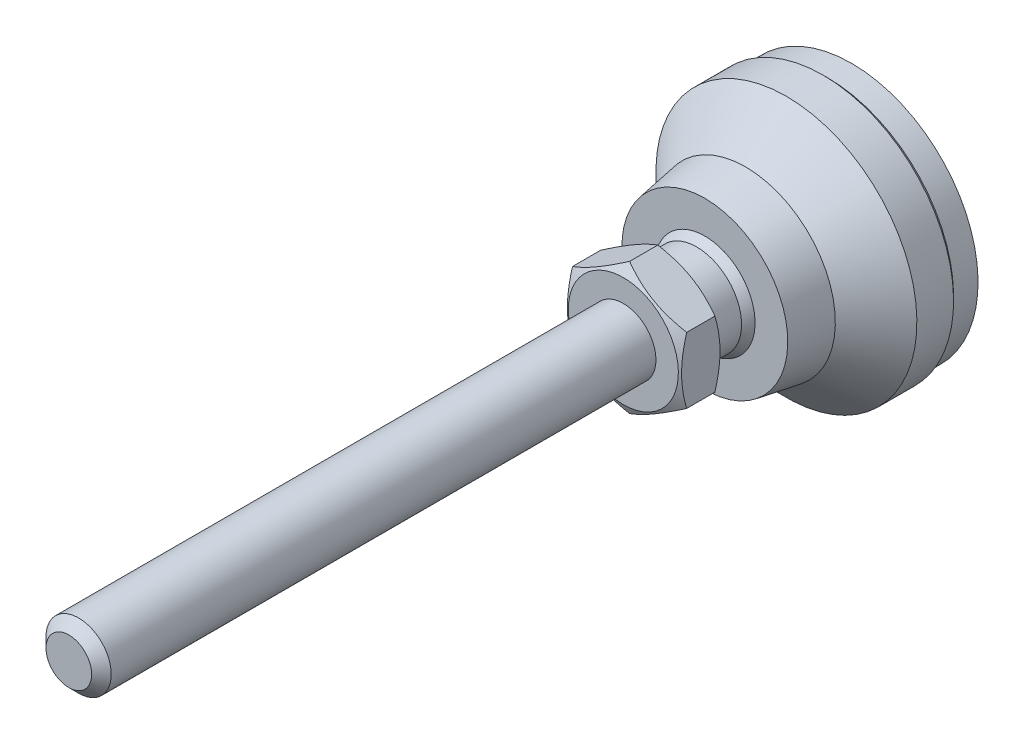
ISO-10303-21;
HEADER;
FILE_DESCRIPTION(('STEP AP214'),'2;1');
FILE_NAME('part.step','',(''),(''),'','','');
FILE_SCHEMA(('AUTOMOTIVE_DESIGN { 1 0 10303 214 1 1 1 1 }'));
ENDSEC;
DATA;
#1=APPLICATION_CONTEXT('core data for automotive mechanical design processes');
#2=APPLICATION_PROTOCOL_DEFINITION('international standard','automotive_design',2000,#1);
#3=PRODUCT_CONTEXT('',#1,'mechanical');
#4=PRODUCT('Part','Part','',(#3));
#5=PRODUCT_RELATED_PRODUCT_CATEGORY('part','',(#4));
#6=PRODUCT_DEFINITION_FORMATION('','',#4);
#7=PRODUCT_DEFINITION_CONTEXT('part definition',#1,'design');
#8=PRODUCT_DEFINITION('design','',#6,#7);
#9=PRODUCT_DEFINITION_SHAPE('','',#8);
#10=(LENGTH_UNIT() NAMED_UNIT(*) SI_UNIT(.MILLI.,.METRE.));
#11=(NAMED_UNIT(*) PLANE_ANGLE_UNIT() SI_UNIT($,.RADIAN.));
#12=(NAMED_UNIT(*) SI_UNIT($,.STERADIAN.) SOLID_ANGLE_UNIT());
#13=UNCERTAINTY_MEASURE_WITH_UNIT(LENGTH_MEASURE(1.E-05),#10,'distance_accuracy_value','');
#14=(GEOMETRIC_REPRESENTATION_CONTEXT(3) GLOBAL_UNCERTAINTY_ASSIGNED_CONTEXT((#13)) GLOBAL_UNIT_ASSIGNED_CONTEXT((#10,
#11,#12)) REPRESENTATION_CONTEXT('',''));
#15=CARTESIAN_POINT('',(0.,0.,0.));
#16=DIRECTION('',(0.,0.,1.));
#17=DIRECTION('',(1.,0.,0.));
#18=AXIS2_PLACEMENT_3D('',#15,#16,#17);
#19=CARTESIAN_POINT('',(0.,0.,3.));
#20=DIRECTION('',(0.,0.,-1.));
#21=DIRECTION('',(0.,1.,0.));
#22=AXIS2_PLACEMENT_3D('',#19,#20,#21);
#23=CYLINDRICAL_SURFACE('',#22,5.49999999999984);
#24=CARTESIAN_POINT('',(0.,0.,23.));
#25=DIRECTION('',(0.,0.,-1.));
#26=DIRECTION('',(0.,1.,0.));
#27=AXIS2_PLACEMENT_3D('',#24,#25,#26);
#28=CIRCLE('',#27,5.49999999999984);
#29=CARTESIAN_POINT('',(0.,5.49999999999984,23.));
#30=VERTEX_POINT('',#29);
#31=EDGE_CURVE('E111',#30,#30,#28,.T.);
#32=ORIENTED_EDGE('',*,*,#31,.T.);
#33=EDGE_LOOP('',(#32));
#34=FACE_BOUND('',#33,.T.);
#35=CARTESIAN_POINT('',(0.,0.,19.0000000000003));
#36=DIRECTION('',(0.,0.,1.));
#37=DIRECTION('',(0.,-1.,0.));
#38=AXIS2_PLACEMENT_3D('',#35,#36,#37);
#39=CIRCLE('',#38,5.49999999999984);
#40=CARTESIAN_POINT('',(-5.49999999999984,0.,19.0000000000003));
#41=VERTEX_POINT('',#40);
#42=EDGE_CURVE('E113',#41,#41,#39,.T.);
#43=ORIENTED_EDGE('',*,*,#42,.T.);
#44=EDGE_LOOP('',(#43));
#45=FACE_BOUND('',#44,.T.);
#46=ADVANCED_FACE('F14',(#34,#45),#23,.T.);
#47=CARTESIAN_POINT('',(0.,0.,14.6698729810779));
#48=DIRECTION('',(0.,0.,1.));
#49=DIRECTION('',(-1.,0.,0.));
#50=AXIS2_PLACEMENT_3D('',#47,#48,#49);
#51=SPHERICAL_SURFACE('',#50,7.);
#52=CARTESIAN_POINT('',(0.,0.,18.));
#53=DIRECTION('',(0.,0.,1.));
#54=DIRECTION('',(0.,-1.,0.));
#55=AXIS2_PLACEMENT_3D('',#52,#53,#54);
#56=CIRCLE('',#55,6.15713034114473);
#57=CARTESIAN_POINT('',(-6.15713034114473,0.,18.));
#58=VERTEX_POINT('',#57);
#59=EDGE_CURVE('E118',#58,#58,#56,.T.);
#60=CARTESIAN_POINT('',(-5.49999999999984,0.,19.0000000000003));
#61=CARTESIAN_POINT('',(-5.50771979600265,0.,18.9901945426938));
#62=CARTESIAN_POINT('',(-5.51541336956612,0.,18.9803684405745));
#63=CARTESIAN_POINT('',(-5.53074785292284,0.,18.9606752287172));
#64=CARTESIAN_POINT('',(-5.53838876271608,0.,18.9508081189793));
#65=CARTESIAN_POINT('',(-5.55361769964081,0.,18.9310331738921));
#66=CARTESIAN_POINT('',(-5.56120572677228,0.,18.9211253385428));
#67=CARTESIAN_POINT('',(-5.57632868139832,0.,18.9012692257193));
#68=CARTESIAN_POINT('',(-5.58386360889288,0.,18.8913209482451));
#69=CARTESIAN_POINT('',(-5.59888014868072,0.,18.871384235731));
#70=CARTESIAN_POINT('',(-5.60636176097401,0.,18.8613958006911));
#71=CARTESIAN_POINT('',(-5.62127145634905,0.,18.841379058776));
#72=CARTESIAN_POINT('',(-5.62869953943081,0.,18.8313507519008));
#73=CARTESIAN_POINT('',(-5.64350196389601,0.,18.81125455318));
#74=CARTESIAN_POINT('',(-5.65087630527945,0.,18.8011866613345));
#75=CARTESIAN_POINT('',(-5.66557103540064,0.,18.781011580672));
#76=CARTESIAN_POINT('',(-5.67289142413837,0.,18.770904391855));
#77=CARTESIAN_POINT('',(-5.68747803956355,0.,18.7506510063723));
#78=CARTESIAN_POINT('',(-5.69474426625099,0.,18.7405048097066));
#79=CARTESIAN_POINT('',(-5.70922234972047,0.,18.7201736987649));
#80=CARTESIAN_POINT('',(-5.7164342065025,0.,18.7099887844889));
#81=CARTESIAN_POINT('',(-5.7308033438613,0.,18.6895805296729));
#82=CARTESIAN_POINT('',(-5.73796062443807,0.,18.6793571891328));
#83=CARTESIAN_POINT('',(-5.75222040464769,0.,18.6588723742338));
#84=CARTESIAN_POINT('',(-5.75932290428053,0.,18.6486108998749));
#85=CARTESIAN_POINT('',(-5.77347291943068,0.,18.6280501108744));
#86=CARTESIAN_POINT('',(-5.78052043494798,0.,18.6177507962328));
#87=CARTESIAN_POINT('',(-5.79456028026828,0.,18.5971146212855));
#88=CARTESIAN_POINT('',(-5.80155261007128,0.,18.5867777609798));
#89=CARTESIAN_POINT('',(-5.81548188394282,0.,18.5660667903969));
#90=CARTESIAN_POINT('',(-5.82241882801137,0.,18.5556926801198));
#91=CARTESIAN_POINT('',(-5.83623713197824,0.,18.5349075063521));
#92=CARTESIAN_POINT('',(-5.84311849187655,0.,18.5244964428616));
#93=CARTESIAN_POINT('',(-5.85682543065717,0.,18.5036376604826));
#94=CARTESIAN_POINT('',(-5.86365100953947,0.,18.493189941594));
#95=CARTESIAN_POINT('',(-5.87724619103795,0.,18.4722581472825));
#96=CARTESIAN_POINT('',(-5.88401579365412,0.,18.4617740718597));
#97=CARTESIAN_POINT('',(-5.89749882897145,0.,18.4407698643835));
#98=CARTESIAN_POINT('',(-5.90421226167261,0.,18.4302497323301));
#99=CARTESIAN_POINT('',(-5.91758276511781,0.,18.4091737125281));
#100=CARTESIAN_POINT('',(-5.92423983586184,0.,18.3986178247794));
#101=CARTESIAN_POINT('',(-5.93749742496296,0.,18.3774705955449));
#102=CARTESIAN_POINT('',(-5.94409794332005,0.,18.366879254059));
#103=CARTESIAN_POINT('',(-5.95724223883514,0.,18.3456614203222));
#104=CARTESIAN_POINT('',(-5.96378601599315,0.,18.3350349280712));
#105=CARTESIAN_POINT('',(-5.9768166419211,0.,18.313747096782));
#106=CARTESIAN_POINT('',(-5.98330349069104,0.,18.3030857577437));
#107=CARTESIAN_POINT('',(-5.99622007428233,0.,18.2817285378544));
#108=CARTESIAN_POINT('',(-6.00264980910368,0.,18.2710326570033));
#109=CARTESIAN_POINT('',(-6.015451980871,0.,18.249606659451));
#110=CARTESIAN_POINT('',(-6.02182441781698,0.,18.2388765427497));
#111=CARTESIAN_POINT('',(-6.034511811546,0.,18.217382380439));
#112=CARTESIAN_POINT('',(-6.04082676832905,0.,18.2066183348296));
#113=CARTESIAN_POINT('',(-6.05339902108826,0.,18.1850566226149));
#114=CARTESIAN_POINT('',(-6.05965631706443,0.,18.1742589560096));
#115=CARTESIAN_POINT('',(-6.07211306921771,0.,18.1526303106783));
#116=CARTESIAN_POINT('',(-6.07831252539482,0.,18.1417993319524));
#117=CARTESIAN_POINT('',(-6.09065342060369,0.,18.1201043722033));
#118=CARTESIAN_POINT('',(-6.09679485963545,0.,18.1092403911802));
#119=CARTESIAN_POINT('',(-6.10901954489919,0.,18.0874797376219));
#120=CARTESIAN_POINT('',(-6.11510279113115,0.,18.0765830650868));
#121=CARTESIAN_POINT('',(-6.12721091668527,0.,18.054757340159));
#122=CARTESIAN_POINT('',(-6.13323579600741,0.,18.0438282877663));
#123=CARTESIAN_POINT('',(-6.14522701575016,0.,18.0219381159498));
#124=CARTESIAN_POINT('',(-6.15119335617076,0.,18.010976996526));
#125=CARTESIAN_POINT('',(-6.15713034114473,0.,18.));
#126=B_SPLINE_CURVE_WITH_KNOTS('',3,(#60,#61,#62,#63,#64,#65,#66,#67,#68,#69,#70,#71,#72,#73,
#74,#75,#76,#77,#78,#79,#80,#81,#82,#83,#84,#85,#86,#87,#88,#89,#90,#91,#92,#93,#94,#95,#96,#97,
#98,#99,#100,#101,#102,#103,#104,#105,#106,#107,#108,#109,#110,#111,#112,#113,#114,#115,#116,
#117,#118,#119,#120,#121,#122,#123,#124,#125),.UNSPECIFIED.,.F.,.F.,(4,2,2,2,2,2,2,2,2,2,2,2,2,
2,2,2,2,2,2,2,2,2,2,2,2,2,2,2,2,2,2,2,4),(0.,0.0374389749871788,0.0748779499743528,
0.112316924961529,0.149755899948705,0.187194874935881,0.224633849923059,0.262072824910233,
0.29951179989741,0.336950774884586,0.374389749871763,0.411828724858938,0.449267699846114,
0.486706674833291,0.524145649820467,0.561584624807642,0.599023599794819,0.636462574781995,
0.673901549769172,0.711340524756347,0.748779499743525,0.786218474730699,0.823657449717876,
0.86109642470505,0.898535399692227,0.935974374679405,0.973413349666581,1.01085232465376,
1.04829129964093,1.08573027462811,1.12316924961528,1.16060822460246,1.19804719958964),.UNSPECIFIED.);
#127=EDGE_CURVE('BSEAM157',#41,#58,#126,.T.);
#128=ORIENTED_EDGE('',*,*,#42,.F.);
#129=ORIENTED_EDGE('',*,*,#59,.T.);
#130=ORIENTED_EDGE('',*,*,#127,.T.);
#131=ORIENTED_EDGE('',*,*,#127,.F.);
#132=EDGE_LOOP('',(#128,#130,#129,#131));
#133=FACE_BOUND('',#132,.T.);
#134=ADVANCED_FACE('F157',(#133),#51,.T.);
#135=CARTESIAN_POINT('',(0.,0.,3.50000000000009));
#136=DIRECTION('',(0.,0.,1.));
#137=DIRECTION('',(0.,-1.,0.));
#138=AXIS2_PLACEMENT_3D('',#135,#136,#137);
#139=CONICAL_SURFACE('',#138,16.,0.785398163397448);
#140=CARTESIAN_POINT('',(0.,0.,3.00000000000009));
#141=DIRECTION('',(0.,0.,-1.));
#142=DIRECTION('',(0.,1.,0.));
#143=AXIS2_PLACEMENT_3D('',#140,#141,#142);
#144=CIRCLE('',#143,15.5);
#145=CARTESIAN_POINT('',(0.,15.5,3.00000000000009));
#146=VERTEX_POINT('',#145);
#147=EDGE_CURVE('E87',#146,#146,#144,.T.);
#148=ORIENTED_EDGE('',*,*,#147,.F.);
#149=EDGE_LOOP('',(#148));
#150=FACE_BOUND('',#149,.T.);
#151=CARTESIAN_POINT('',(0.,0.,3.50000000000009));
#152=DIRECTION('',(0.,0.,-1.));
#153=DIRECTION('',(0.,1.,0.));
#154=AXIS2_PLACEMENT_3D('',#151,#152,#153);
#155=CIRCLE('',#154,16.);
#156=CARTESIAN_POINT('',(0.,16.,3.50000000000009));
#157=VERTEX_POINT('',#156);
#158=EDGE_CURVE('E90',#157,#157,#155,.T.);
#159=ORIENTED_EDGE('',*,*,#158,.T.);
#160=EDGE_LOOP('',(#159));
#161=FACE_BOUND('',#160,.T.);
#162=ADVANCED_FACE('F162',(#150,#161),#139,.T.);
#163=CARTESIAN_POINT('',(0.,0.,3.));
#164=DIRECTION('',(0.,0.,-1.));
#165=DIRECTION('',(0.,1.,0.));
#166=AXIS2_PLACEMENT_3D('',#163,#164,#165);
#167=CYLINDRICAL_SURFACE('',#166,16.);
#168=ORIENTED_EDGE('',*,*,#158,.F.);
#169=EDGE_LOOP('',(#168));
#170=FACE_BOUND('',#169,.T.);
#171=CARTESIAN_POINT('',(0.,0.,8.00000000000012));
#172=DIRECTION('',(0.,0.,-1.));
#173=DIRECTION('',(0.,1.,0.));
#174=AXIS2_PLACEMENT_3D('',#171,#172,#173);
#175=CIRCLE('',#174,16.);
#176=CARTESIAN_POINT('',(0.,16.,8.00000000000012));
#177=VERTEX_POINT('',#176);
#178=EDGE_CURVE('E107',#177,#177,#175,.T.);
#179=ORIENTED_EDGE('',*,*,#178,.T.);
#180=EDGE_LOOP('',(#179));
#181=FACE_BOUND('',#180,.T.);
#182=ADVANCED_FACE('F168',(#170,#181),#167,.T.);
#183=CARTESIAN_POINT('',(0.,0.,13.));
#184=DIRECTION('',(0.,0.,-1.));
#185=DIRECTION('',(0.,1.,0.));
#186=AXIS2_PLACEMENT_3D('',#183,#184,#185);
#187=CONICAL_SURFACE('',#186,11.,0.785398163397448);
#188=ORIENTED_EDGE('',*,*,#178,.F.);
#189=EDGE_LOOP('',(#188));
#190=FACE_BOUND('',#189,.T.);
#191=CARTESIAN_POINT('',(0.,0.,13.));
#192=DIRECTION('',(0.,0.,-1.));
#193=DIRECTION('',(0.,1.,0.));
#194=AXIS2_PLACEMENT_3D('',#191,#192,#193);
#195=CIRCLE('',#194,11.);
#196=CARTESIAN_POINT('',(0.,11.,13.));
#197=VERTEX_POINT('',#196);
#198=EDGE_CURVE('E28',#197,#197,#195,.T.);
#199=ORIENTED_EDGE('',*,*,#198,.T.);
#200=EDGE_LOOP('',(#199));
#201=FACE_BOUND('',#200,.T.);
#202=ADVANCED_FACE('F151',(#190,#201),#187,.T.);
#203=CARTESIAN_POINT('',(0.,0.,19.));
#204=DIRECTION('',(0.,0.,-1.));
#205=DIRECTION('',(0.,1.,0.));
#206=AXIS2_PLACEMENT_3D('',#203,#204,#205);
#207=CONICAL_SURFACE('',#206,10.,0.165148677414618);
#208=ORIENTED_EDGE('',*,*,#198,.F.);
#209=EDGE_LOOP('',(#208));
#210=FACE_BOUND('',#209,.T.);
#211=CARTESIAN_POINT('',(0.,0.,18.));
#212=DIRECTION('',(0.,0.,-1.));
#213=DIRECTION('',(0.,1.,0.));
#214=AXIS2_PLACEMENT_3D('',#211,#212,#213);
#215=CIRCLE('',#214,10.1666666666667);
#216=CARTESIAN_POINT('',(0.,10.1666666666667,18.));
#217=VERTEX_POINT('',#216);
#218=EDGE_CURVE('E95',#217,#217,#215,.T.);
#219=ORIENTED_EDGE('',*,*,#218,.T.);
#220=EDGE_LOOP('',(#219));
#221=FACE_BOUND('',#220,.T.);
#222=ADVANCED_FACE('F135',(#210,#221),#207,.T.);
#223=CARTESIAN_POINT('',(-10.1666666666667,0.,18.));
#224=DIRECTION('',(0.,0.,1.));
#225=DIRECTION('',(0.,-1.,0.));
#226=AXIS2_PLACEMENT_3D('',#223,#224,#225);
#227=PLANE('',#226);
#228=ORIENTED_EDGE('',*,*,#218,.F.);
#229=EDGE_LOOP('',(#228));
#230=FACE_BOUND('',#229,.T.);
#231=ORIENTED_EDGE('',*,*,#59,.F.);
#232=EDGE_LOOP('',(#231));
#233=FACE_BOUND('',#232,.T.);
#234=ADVANCED_FACE('F137',(#230,#233),#227,.T.);
#235=CARTESIAN_POINT('',(0.,-8.08290376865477,23.));
#236=DIRECTION('',(0.,0.,-1.));
#237=DIRECTION('',(0.,1.,0.));
#238=AXIS2_PLACEMENT_3D('',#235,#236,#237);
#239=PLANE('',#238);
#240=CARTESIAN_POINT('',(0.,0.,23.));
#241=DIRECTION('',(0.,0.,1.));
#242=DIRECTION('',(0.,-1.,0.));
#243=AXIS2_PLACEMENT_3D('',#240,#241,#242);
#244=CIRCLE('',#243,6.75);
#245=CARTESIAN_POINT('',(0.,-6.75,23.));
#246=VERTEX_POINT('',#245);
#247=EDGE_CURVE('E81',#246,#246,#244,.T.);
#248=ORIENTED_EDGE('',*,*,#247,.F.);
#249=EDGE_LOOP('',(#248));
#250=FACE_BOUND('',#249,.T.);
#251=ORIENTED_EDGE('',*,*,#31,.F.);
#252=EDGE_LOOP('',(#251));
#253=FACE_BOUND('',#252,.T.);
#254=ADVANCED_FACE('F140',(#250,#253),#239,.T.);
#255=CARTESIAN_POINT('',(0.,0.,0.));
#256=DIRECTION('',(0.,0.,1.));
#257=DIRECTION('',(0.,-1.,0.));
#258=AXIS2_PLACEMENT_3D('',#255,#256,#257);
#259=CYLINDRICAL_SURFACE('',#258,15.5);
#260=CARTESIAN_POINT('',(0.,0.,0.));
#261=DIRECTION('',(0.,0.,-1.));
#262=DIRECTION('',(0.,1.,0.));
#263=AXIS2_PLACEMENT_3D('',#260,#261,#262);
#264=CIRCLE('',#263,15.5);
#265=CARTESIAN_POINT('',(0.,15.5,0.));
#266=VERTEX_POINT('',#265);
#267=EDGE_CURVE('E293',#266,#266,#264,.T.);
#268=ORIENTED_EDGE('',*,*,#267,.F.);
#269=EDGE_LOOP('',(#268));
#270=FACE_BOUND('',#269,.T.);
#271=ORIENTED_EDGE('',*,*,#147,.T.);
#272=EDGE_LOOP('',(#271));
#273=FACE_BOUND('',#272,.T.);
#274=ADVANCED_FACE('F148',(#270,#273),#259,.T.);
#275=CARTESIAN_POINT('',(0.,0.,0.));
#276=DIRECTION('',(0.,0.,-1.));
#277=DIRECTION('',(0.,1.,0.));
#278=AXIS2_PLACEMENT_3D('',#275,#276,#277);
#279=PLANE('',#278);
#280=ORIENTED_EDGE('',*,*,#267,.T.);
#281=EDGE_LOOP('',(#280));
#282=FACE_BOUND('',#281,.T.);
#283=ADVANCED_FACE('F205',(#282),#279,.T.);
#284=CARTESIAN_POINT('',(0.,0.,23.));
#285=DIRECTION('',(0.,0.,1.));
#286=DIRECTION('',(0.,-1.,0.));
#287=AXIS2_PLACEMENT_3D('',#284,#285,#286);
#288=CONICAL_SURFACE('',#287,6.75,1.0471975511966);
#289=CARTESIAN_POINT('',(7.0002,-4.04133641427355,23.7696190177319));
#290=CARTESIAN_POINT('',(6.84633209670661,-4.13017208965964,23.7183374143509));
#291=CARTESIAN_POINT('',(6.69189049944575,-4.21933898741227,23.669383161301));
#292=CARTESIAN_POINT('',(6.38175307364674,-4.3983969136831,23.5767703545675));
#293=CARTESIAN_POINT('',(6.22605673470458,-4.4882882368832,23.5331140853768));
#294=CARTESIAN_POINT('',(5.75647483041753,-4.7594014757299,23.4109491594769));
#295=CARTESIAN_POINT('',(5.4407356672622,-4.94169356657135,23.3414631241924));
#296=CARTESIAN_POINT('',(4.96823775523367,-5.21449036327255,23.2599825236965));
#297=CARTESIAN_POINT('',(4.81289077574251,-5.30417998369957,23.2367710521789));
#298=CARTESIAN_POINT('',(4.50149488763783,-5.48396448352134,23.1978487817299));
#299=CARTESIAN_POINT('',(4.34544604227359,-5.57405932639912,23.1821373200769));
#300=CARTESIAN_POINT('',(4.03307732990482,-5.75440548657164,23.1586154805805));
#301=CARTESIAN_POINT('',(3.87675797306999,-5.84465650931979,23.1507961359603));
#302=CARTESIAN_POINT('',(3.56398349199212,-6.02523694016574,23.1432178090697));
#303=CARTESIAN_POINT('',(3.40752837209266,-6.11556634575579,23.1434585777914));
#304=CARTESIAN_POINT('',(2.97889312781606,-6.36303901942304,23.155197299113));
#305=CARTESIAN_POINT('',(2.7068533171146,-6.52010127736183,23.1749033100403));
#306=CARTESIAN_POINT('',(2.1645805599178,-6.8331825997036,23.2373910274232));
#307=CARTESIAN_POINT('',(1.89434952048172,-6.98920056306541,23.2801940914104));
#308=CARTESIAN_POINT('',(1.35098545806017,-7.30291195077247,23.3871892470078));
#309=CARTESIAN_POINT('',(1.07792099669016,-7.46056579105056,23.4518346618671));
#310=CARTESIAN_POINT('',(0.535864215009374,-7.77352241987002,23.5985536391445));
#311=CARTESIAN_POINT('',(0.266864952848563,-7.92882921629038,23.680592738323));
#312=CARTESIAN_POINT('',(-0.000199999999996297,-8.08301923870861,23.7696190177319));
#313=B_SPLINE_CURVE_WITH_KNOTS('',3,(#289,#290,#291,#292,#293,#294,#295,#296,#297,#298,#299,
#300,#301,#302,#303,#304,#305,#306,#307,#308,#309,#310,#311,#312),.UNSPECIFIED.,.F.,.F.,(4,2,2,
2,2,2,2,2,2,2,2,4),(0.,0.554727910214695,1.10969417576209,2.2219327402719,2.76443041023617,
3.30688013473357,3.8487128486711,4.39052882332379,5.33376515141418,6.27787517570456,
7.24292418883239,8.20607866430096),.UNSPECIFIED.);
#314=CARTESIAN_POINT('',(7.,-4.04145188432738,23.7695523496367));
#315=VERTEX_POINT('',#314);
#316=CARTESIAN_POINT('',(0.,-8.08290376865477,23.7695523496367));
#317=VERTEX_POINT('',#316);
#318=EDGE_CURVE('E34',#315,#317,#313,.T.);
#319=ORIENTED_EDGE('',*,*,#318,.T.);
#320=CARTESIAN_POINT('',(0.000200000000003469,-8.0830192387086,23.7696190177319));
#321=CARTESIAN_POINT('',(-0.15366790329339,-7.99418356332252,23.7183374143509));
#322=CARTESIAN_POINT('',(-0.308109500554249,-7.90501666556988,23.669383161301));
#323=CARTESIAN_POINT('',(-0.618246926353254,-7.72595873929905,23.5767703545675));
#324=CARTESIAN_POINT('',(-0.773943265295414,-7.63606741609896,23.5331140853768));
#325=CARTESIAN_POINT('',(-1.24352516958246,-7.36495417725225,23.4109491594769));
#326=CARTESIAN_POINT('',(-1.5592643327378,-7.18266208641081,23.3414631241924));
#327=CARTESIAN_POINT('',(-2.03176224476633,-6.90986528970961,23.2599825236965));
#328=CARTESIAN_POINT('',(-2.18710922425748,-6.82017566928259,23.2367710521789));
#329=CARTESIAN_POINT('',(-2.49850511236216,-6.64039116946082,23.1978487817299));
#330=CARTESIAN_POINT('',(-2.65455395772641,-6.55029632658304,23.1821373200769));
#331=CARTESIAN_POINT('',(-2.96692267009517,-6.36995016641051,23.1586154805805));
#332=CARTESIAN_POINT('',(-3.12324202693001,-6.27969914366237,23.1507961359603));
#333=CARTESIAN_POINT('',(-3.43601650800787,-6.09911871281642,23.1432178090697));
#334=CARTESIAN_POINT('',(-3.59247162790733,-6.00878930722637,23.1434585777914));
#335=CARTESIAN_POINT('',(-4.02110687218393,-5.76131663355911,23.155197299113));
#336=CARTESIAN_POINT('',(-4.29314668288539,-5.60425437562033,23.1749033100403));
#337=CARTESIAN_POINT('',(-4.83541944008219,-5.29117305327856,23.2373910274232));
#338=CARTESIAN_POINT('',(-5.10565047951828,-5.13515508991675,23.2801940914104));
#339=CARTESIAN_POINT('',(-5.64901454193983,-4.82144370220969,23.3871892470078));
#340=CARTESIAN_POINT('',(-5.92207900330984,-4.6637898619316,23.4518346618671));
#341=CARTESIAN_POINT('',(-6.46413578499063,-4.35083323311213,23.5985536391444));
#342=CARTESIAN_POINT('',(-6.73313504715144,-4.19552643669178,23.680592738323));
#343=CARTESIAN_POINT('',(-7.0002,-4.04133641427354,23.7696190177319));
#344=B_SPLINE_CURVE_WITH_KNOTS('',3,(#320,#321,#322,#323,#324,#325,#326,#327,#328,#329,#330,
#331,#332,#333,#334,#335,#336,#337,#338,#339,#340,#341,#342,#343),.UNSPECIFIED.,.F.,.F.,(4,2,2,
2,2,2,2,2,2,2,2,4),(0.,0.554727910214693,1.10969417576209,2.2219327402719,2.76443041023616,
3.30688013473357,3.84871284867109,4.39052882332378,5.33376515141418,6.27787517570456,
7.2429241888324,8.20607866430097),.UNSPECIFIED.);
#345=CARTESIAN_POINT('',(-7.,-4.04145188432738,23.7695523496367));
#346=VERTEX_POINT('',#345);
#347=EDGE_CURVE('E9',#317,#346,#344,.T.);
#348=ORIENTED_EDGE('',*,*,#347,.T.);
#349=CARTESIAN_POINT('',(-7.,10.8480700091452,26.5567576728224));
#350=CARTESIAN_POINT('',(-7.,10.5423982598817,26.4085107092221));
#351=CARTESIAN_POINT('',(-7.,10.2360239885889,26.2616874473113));
#352=CARTESIAN_POINT('',(-7.,9.62149675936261,25.9716892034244));
#353=CARTESIAN_POINT('',(-7.,9.3133435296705,25.8285147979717));
#354=CARTESIAN_POINT('',(-7.,8.69329333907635,25.5458931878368));
#355=CARTESIAN_POINT('',(-7.,8.38138512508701,25.406470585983));
#356=CARTESIAN_POINT('',(-7.,7.75508521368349,25.1333414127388));
#357=CARTESIAN_POINT('',(-7.,7.44069363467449,24.9996345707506));
#358=CARTESIAN_POINT('',(-7.,6.79881012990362,24.7352798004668));
#359=CARTESIAN_POINT('',(-7.,6.47122095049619,24.6048667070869));
#360=CARTESIAN_POINT('',(-7.,5.81220795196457,24.3539294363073));
#361=CARTESIAN_POINT('',(-7.,5.48078370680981,24.2334063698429));
#362=CARTESIAN_POINT('',(-7.,4.81419211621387,24.005419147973));
#363=CARTESIAN_POINT('',(-7.,4.47903393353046,23.8979284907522));
#364=CARTESIAN_POINT('',(-7.,3.80392198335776,23.6994589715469));
#365=CARTESIAN_POINT('',(-7.,3.46396976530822,23.6084749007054));
#366=CARTESIAN_POINT('',(-7.,2.78090492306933,23.4478793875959));
#367=CARTESIAN_POINT('',(-7.,2.43782022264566,23.378152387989));
#368=CARTESIAN_POINT('',(-7.,1.92007513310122,23.2925273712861));
#369=CARTESIAN_POINT('',(-7.,1.74696099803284,23.2671454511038));
#370=CARTESIAN_POINT('',(-7.,1.39987489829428,23.2232014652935));
#371=CARTESIAN_POINT('',(-7.,1.22590301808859,23.2046387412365));
#372=CARTESIAN_POINT('',(-7.,0.879603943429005,23.1749353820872));
#373=CARTESIAN_POINT('',(-7.,0.707284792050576,23.1637013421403));
#374=CARTESIAN_POINT('',(-7.,0.362325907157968,23.1485297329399));
#375=CARTESIAN_POINT('',(-7.,0.189686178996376,23.1445920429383));
#376=CARTESIAN_POINT('',(-7.,-0.155605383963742,23.1441070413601));
#377=CARTESIAN_POINT('',(-7.,-0.328257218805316,23.1475597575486));
#378=CARTESIAN_POINT('',(-7.,-0.673262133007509,23.1617713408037));
#379=CARTESIAN_POINT('',(-7.,-0.845615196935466,23.1725305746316));
#380=CARTESIAN_POINT('',(-7.,-1.26006485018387,23.206960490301));
#381=CARTESIAN_POINT('',(-7.,-1.50187844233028,23.2341107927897));
#382=CARTESIAN_POINT('',(-7.,-1.98369444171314,23.3013107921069));
#383=CARTESIAN_POINT('',(-7.,-2.22369659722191,23.3413622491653));
#384=CARTESIAN_POINT('',(-7.,-2.94072063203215,23.4787432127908));
#385=CARTESIAN_POINT('',(-7.,-3.41448947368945,23.5932738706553));
#386=CARTESIAN_POINT('',(-7.,-4.12289293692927,23.7916775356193));
#387=CARTESIAN_POINT('',(-7.,-4.3612070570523,23.8631666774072));
#388=CARTESIAN_POINT('',(-7.,-4.83552025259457,24.0135197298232));
#389=CARTESIAN_POINT('',(-7.,-5.07151931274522,24.0923836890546));
#390=CARTESIAN_POINT('',(-7.,-5.54127762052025,24.2562251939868));
#391=CARTESIAN_POINT('',(-7.,-5.77503758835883,24.3412006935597));
#392=CARTESIAN_POINT('',(-7.,-6.24062409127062,24.516270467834));
#393=CARTESIAN_POINT('',(-7.,-6.47245064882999,24.6063646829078));
#394=CARTESIAN_POINT('',(-7.,-7.01893128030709,24.8245810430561));
#395=CARTESIAN_POINT('',(-7.,-7.3328454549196,24.9545526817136));
#396=CARTESIAN_POINT('',(-7.,-7.95801115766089,25.2207674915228));
#397=CARTESIAN_POINT('',(-7.,-8.26926252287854,25.3570110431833));
#398=CARTESIAN_POINT('',(-7.,-8.8895918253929,25.6345112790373));
#399=CARTESIAN_POINT('',(-7.,-9.19866931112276,25.7757689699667));
#400=CARTESIAN_POINT('',(-7.,-9.81496298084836,26.0622950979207));
#401=CARTESIAN_POINT('',(-7.,-10.1221791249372,26.2075636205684));
#402=CARTESIAN_POINT('',(-7.,-10.7353754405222,26.5015129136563));
#403=CARTESIAN_POINT('',(-7.,-11.0413539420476,26.6501971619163));
#404=CARTESIAN_POINT('',(-7.,-11.6519936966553,26.9502489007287));
#405=CARTESIAN_POINT('',(-7.,-11.9566549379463,27.1016164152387));
#406=CARTESIAN_POINT('',(-7.,-12.8688963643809,27.5589903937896));
#407=CARTESIAN_POINT('',(-7.,-13.4748162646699,27.8683079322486));
#408=CARTESIAN_POINT('',(-7.,-14.632801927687,28.4669754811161));
#409=CARTESIAN_POINT('',(-7.,-15.185126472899,28.7558271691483));
#410=CARTESIAN_POINT('',(-7.,-16.2877240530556,29.3374639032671));
#411=CARTESIAN_POINT('',(-7.,-16.8379970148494,29.630249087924));
#412=CARTESIAN_POINT('',(-7.,-17.935574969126,30.2180830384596));
#413=CARTESIAN_POINT('',(-7.,-18.4828839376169,30.5131243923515));
#414=CARTESIAN_POINT('',(-7.,-19.5761900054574,31.1055572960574));
#415=CARTESIAN_POINT('',(-7.,-20.1221871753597,31.4029487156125));
#416=CARTESIAN_POINT('',(-7.,-20.6677014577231,31.701217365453));
#417=B_SPLINE_CURVE_WITH_KNOTS('',3,(#349,#350,#351,#352,#353,#354,#355,#356,#357,#358,#359,
#360,#361,#362,#363,#364,#365,#366,#367,#368,#369,#370,#371,#372,#373,#374,#375,#376,#377,#378,
#379,#380,#381,#382,#383,#384,#385,#386,#387,#388,#389,#390,#391,#392,#393,#394,#395,#396,#397,
#398,#399,#400,#401,#402,#403,#404,#405,#406,#407,#408,#409,#410,#411,#412,#413,#414,#415,#416),
.UNSPECIFIED.,.F.,.F.,(4,2,2,2,2,2,2,2,2,2,2,2,2,2,2,2,2,2,2,2,2,2,2,2,2,2,2,2,2,2,2,2,2,4),(0.,
1.01918441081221,2.03852886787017,3.06343587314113,4.08829430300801,5.14595119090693,
6.20372672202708,7.25931381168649,8.31456721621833,9.363977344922,9.88875911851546,
10.4134902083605,10.9313956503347,11.4492925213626,11.9671913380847,12.4851161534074,
13.2147027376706,13.94438890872,15.404572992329,16.1509286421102,16.8972892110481,
17.6434010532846,18.3895042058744,19.4086829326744,20.4279235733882,21.4473700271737,
22.4668382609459,23.4873950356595,24.5079609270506,26.5488194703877,28.4186900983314,
30.2886267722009,32.1539272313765,34.0191250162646),.UNSPECIFIED.);
#418=CARTESIAN_POINT('',(-7.,4.04145188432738,23.7695523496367));
#419=VERTEX_POINT('',#418);
#420=EDGE_CURVE('E73',#346,#419,#417,.F.);
#421=ORIENTED_EDGE('',*,*,#420,.T.);
#422=CARTESIAN_POINT('',(-7.0002,4.04133641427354,23.7696190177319));
#423=CARTESIAN_POINT('',(-6.84633209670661,4.13017208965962,23.7183374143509));
#424=CARTESIAN_POINT('',(-6.69189049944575,4.21933898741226,23.669383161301));
#425=CARTESIAN_POINT('',(-6.38175307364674,4.39839691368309,23.5767703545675));
#426=CARTESIAN_POINT('',(-6.22605673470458,4.48828823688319,23.5331140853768));
#427=CARTESIAN_POINT('',(-5.75647483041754,4.75940147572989,23.4109491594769));
#428=CARTESIAN_POINT('',(-5.4407356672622,4.94169356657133,23.3414631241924));
#429=CARTESIAN_POINT('',(-4.96823775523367,5.21449036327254,23.2599825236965));
#430=CARTESIAN_POINT('',(-4.81289077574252,5.30417998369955,23.2367710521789));
#431=CARTESIAN_POINT('',(-4.50149488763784,5.48396448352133,23.1978487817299));
#432=CARTESIAN_POINT('',(-4.34544604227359,5.57405932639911,23.1821373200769));
#433=CARTESIAN_POINT('',(-4.03307732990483,5.75440548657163,23.1586154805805));
#434=CARTESIAN_POINT('',(-3.87675797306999,5.84465650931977,23.1507961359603));
#435=CARTESIAN_POINT('',(-3.56398349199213,6.02523694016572,23.1432178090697));
#436=CARTESIAN_POINT('',(-3.40752837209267,6.11556634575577,23.1434585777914));
#437=CARTESIAN_POINT('',(-2.97889312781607,6.36303901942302,23.155197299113));
#438=CARTESIAN_POINT('',(-2.7068533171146,6.52010127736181,23.1749033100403));
#439=CARTESIAN_POINT('',(-2.16458055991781,6.83318259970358,23.2373910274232));
#440=CARTESIAN_POINT('',(-1.89434952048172,6.9892005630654,23.2801940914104));
#441=CARTESIAN_POINT('',(-1.35098545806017,7.30291195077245,23.3871892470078));
#442=CARTESIAN_POINT('',(-1.07792099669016,7.46056579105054,23.4518346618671));
#443=CARTESIAN_POINT('',(-0.535864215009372,7.77352241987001,23.5985536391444));
#444=CARTESIAN_POINT('',(-0.266864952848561,7.92882921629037,23.680592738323));
#445=CARTESIAN_POINT('',(0.000199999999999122,8.0830192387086,23.7696190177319));
#446=B_SPLINE_CURVE_WITH_KNOTS('',3,(#422,#423,#424,#425,#426,#427,#428,#429,#430,#431,#432,
#433,#434,#435,#436,#437,#438,#439,#440,#441,#442,#443,#444,#445),.UNSPECIFIED.,.F.,.F.,(4,2,2,
2,2,2,2,2,2,2,2,4),(0.,0.554727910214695,1.10969417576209,2.2219327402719,2.76443041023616,
3.30688013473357,3.84871284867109,4.39052882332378,5.33376515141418,6.27787517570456,
7.2429241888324,8.20607866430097),.UNSPECIFIED.);
#447=CARTESIAN_POINT('',(0.,8.08290376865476,23.7695523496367));
#448=VERTEX_POINT('',#447);
#449=EDGE_CURVE('E80',#419,#448,#446,.T.);
#450=ORIENTED_EDGE('',*,*,#449,.T.);
#451=CARTESIAN_POINT('',(-0.000200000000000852,8.0830192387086,23.7696190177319));
#452=CARTESIAN_POINT('',(0.153667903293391,7.99418356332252,23.7183374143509));
#453=CARTESIAN_POINT('',(0.30810950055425,7.90501666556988,23.669383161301));
#454=CARTESIAN_POINT('',(0.618246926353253,7.72595873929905,23.5767703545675));
#455=CARTESIAN_POINT('',(0.773943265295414,7.63606741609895,23.5331140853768));
#456=CARTESIAN_POINT('',(1.24352516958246,7.36495417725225,23.4109491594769));
#457=CARTESIAN_POINT('',(1.5592643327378,7.18266208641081,23.3414631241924));
#458=CARTESIAN_POINT('',(2.03176224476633,6.9098652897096,23.2599825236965));
#459=CARTESIAN_POINT('',(2.18710922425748,6.82017566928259,23.2367710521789));
#460=CARTESIAN_POINT('',(2.49850511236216,6.64039116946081,23.1978487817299));
#461=CARTESIAN_POINT('',(2.6545539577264,6.55029632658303,23.1821373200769));
#462=CARTESIAN_POINT('',(2.96692267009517,6.36995016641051,23.1586154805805));
#463=CARTESIAN_POINT('',(3.12324202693,6.27969914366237,23.1507961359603));
#464=CARTESIAN_POINT('',(3.43601650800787,6.09911871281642,23.1432178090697));
#465=CARTESIAN_POINT('',(3.59247162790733,6.00878930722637,23.1434585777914));
#466=CARTESIAN_POINT('',(4.02110687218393,5.76131663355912,23.155197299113));
#467=CARTESIAN_POINT('',(4.29314668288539,5.60425437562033,23.1749033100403));
#468=CARTESIAN_POINT('',(4.83541944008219,5.29117305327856,23.2373910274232));
#469=CARTESIAN_POINT('',(5.10565047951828,5.13515508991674,23.2801940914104));
#470=CARTESIAN_POINT('',(5.64901454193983,4.82144370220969,23.3871892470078));
#471=CARTESIAN_POINT('',(5.92207900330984,4.66378986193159,23.4518346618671));
#472=CARTESIAN_POINT('',(6.46413578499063,4.35083323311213,23.5985536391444));
#473=CARTESIAN_POINT('',(6.73313504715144,4.19552643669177,23.680592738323));
#474=CARTESIAN_POINT('',(7.0002,4.04133641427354,23.7696190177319));
#475=B_SPLINE_CURVE_WITH_KNOTS('',3,(#451,#452,#453,#454,#455,#456,#457,#458,#459,#460,#461,
#462,#463,#464,#465,#466,#467,#468,#469,#470,#471,#472,#473,#474),.UNSPECIFIED.,.F.,.F.,(4,2,2,
2,2,2,2,2,2,2,2,4),(0.,0.554727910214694,1.10969417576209,2.2219327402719,2.76443041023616,
3.30688013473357,3.84871284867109,4.39052882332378,5.33376515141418,6.27787517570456,
7.2429241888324,8.20607866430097),.UNSPECIFIED.);
#476=CARTESIAN_POINT('',(7.,4.04145188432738,23.7695523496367));
#477=VERTEX_POINT('',#476);
#478=EDGE_CURVE('E253',#448,#477,#475,.T.);
#479=ORIENTED_EDGE('',*,*,#478,.T.);
#480=CARTESIAN_POINT('',(7.,10.8480700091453,26.5567576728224));
#481=CARTESIAN_POINT('',(7.,10.5423982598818,26.4085107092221));
#482=CARTESIAN_POINT('',(7.,10.2360239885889,26.2616874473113));
#483=CARTESIAN_POINT('',(7.,9.62149675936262,25.9716892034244));
#484=CARTESIAN_POINT('',(7.,9.31334352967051,25.8285147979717));
#485=CARTESIAN_POINT('',(7.,8.69329333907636,25.5458931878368));
#486=CARTESIAN_POINT('',(7.,8.38138512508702,25.406470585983));
#487=CARTESIAN_POINT('',(7.,7.7550852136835,25.1333414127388));
#488=CARTESIAN_POINT('',(7.,7.4406936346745,24.9996345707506));
#489=CARTESIAN_POINT('',(7.,6.79881012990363,24.7352798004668));
#490=CARTESIAN_POINT('',(7.,6.4712209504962,24.6048667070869));
#491=CARTESIAN_POINT('',(7.,5.81220795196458,24.3539294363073));
#492=CARTESIAN_POINT('',(7.,5.48078370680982,24.2334063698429));
#493=CARTESIAN_POINT('',(7.,4.81419211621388,24.005419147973));
#494=CARTESIAN_POINT('',(7.,4.47903393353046,23.8979284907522));
#495=CARTESIAN_POINT('',(7.,3.80392198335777,23.6994589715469));
#496=CARTESIAN_POINT('',(7.,3.46396976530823,23.6084749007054));
#497=CARTESIAN_POINT('',(7.,2.78090492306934,23.4478793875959));
#498=CARTESIAN_POINT('',(7.,2.43782022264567,23.378152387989));
#499=CARTESIAN_POINT('',(7.,1.92007513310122,23.2925273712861));
#500=CARTESIAN_POINT('',(7.,1.74696099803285,23.2671454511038));
#501=CARTESIAN_POINT('',(7.,1.39987489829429,23.2232014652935));
#502=CARTESIAN_POINT('',(7.,1.22590301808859,23.2046387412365));
#503=CARTESIAN_POINT('',(7.,0.879603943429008,23.1749353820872));
#504=CARTESIAN_POINT('',(7.,0.707284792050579,23.1637013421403));
#505=CARTESIAN_POINT('',(7.,0.36232590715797,23.1485297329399));
#506=CARTESIAN_POINT('',(7.,0.189686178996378,23.1445920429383));
#507=CARTESIAN_POINT('',(7.,-0.15560538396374,23.1441070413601));
#508=CARTESIAN_POINT('',(7.,-0.328257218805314,23.1475597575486));
#509=CARTESIAN_POINT('',(7.,-0.673262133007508,23.1617713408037));
#510=CARTESIAN_POINT('',(7.,-0.845615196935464,23.1725305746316));
#511=CARTESIAN_POINT('',(7.,-1.26006485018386,23.206960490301));
#512=CARTESIAN_POINT('',(7.,-1.50187844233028,23.2341107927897));
#513=CARTESIAN_POINT('',(7.,-1.98369444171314,23.3013107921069));
#514=CARTESIAN_POINT('',(7.,-2.22369659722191,23.3413622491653));
#515=CARTESIAN_POINT('',(7.,-2.94072063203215,23.4787432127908));
#516=CARTESIAN_POINT('',(7.,-3.41448947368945,23.5932738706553));
#517=CARTESIAN_POINT('',(7.,-4.12289293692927,23.7916775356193));
#518=CARTESIAN_POINT('',(7.,-4.3612070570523,23.8631666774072));
#519=CARTESIAN_POINT('',(7.,-4.83552025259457,24.0135197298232));
#520=CARTESIAN_POINT('',(7.,-5.07151931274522,24.0923836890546));
#521=CARTESIAN_POINT('',(7.,-5.54127762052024,24.2562251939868));
#522=CARTESIAN_POINT('',(7.,-5.77503758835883,24.3412006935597));
#523=CARTESIAN_POINT('',(7.,-6.24062409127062,24.516270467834));
#524=CARTESIAN_POINT('',(7.,-6.47245064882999,24.6063646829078));
#525=CARTESIAN_POINT('',(7.,-7.01893128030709,24.8245810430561));
#526=CARTESIAN_POINT('',(7.,-7.3328454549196,24.9545526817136));
#527=CARTESIAN_POINT('',(7.,-7.95801115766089,25.2207674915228));
#528=CARTESIAN_POINT('',(7.,-8.26926252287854,25.3570110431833));
#529=CARTESIAN_POINT('',(7.,-8.88959182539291,25.6345112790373));
#530=CARTESIAN_POINT('',(7.,-9.19866931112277,25.7757689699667));
#531=CARTESIAN_POINT('',(7.,-9.81496298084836,26.0622950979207));
#532=CARTESIAN_POINT('',(7.,-10.1221791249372,26.2075636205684));
#533=CARTESIAN_POINT('',(7.,-10.7353754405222,26.5015129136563));
#534=CARTESIAN_POINT('',(7.,-11.0413539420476,26.6501971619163));
#535=CARTESIAN_POINT('',(7.,-11.6519936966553,26.9502489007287));
#536=CARTESIAN_POINT('',(7.,-11.9566549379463,27.1016164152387));
#537=CARTESIAN_POINT('',(7.,-12.8688963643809,27.5589903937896));
#538=CARTESIAN_POINT('',(7.,-13.4748162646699,27.8683079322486));
#539=CARTESIAN_POINT('',(7.,-14.632801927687,28.4669754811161));
#540=CARTESIAN_POINT('',(7.,-15.185126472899,28.7558271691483));
#541=CARTESIAN_POINT('',(7.,-16.2877240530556,29.3374639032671));
#542=CARTESIAN_POINT('',(7.,-16.8379970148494,29.630249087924));
#543=CARTESIAN_POINT('',(7.,-17.935574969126,30.2180830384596));
#544=CARTESIAN_POINT('',(7.,-18.4828839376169,30.5131243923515));
#545=CARTESIAN_POINT('',(7.,-19.5761900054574,31.1055572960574));
#546=CARTESIAN_POINT('',(7.,-20.1221871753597,31.4029487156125));
#547=CARTESIAN_POINT('',(7.,-20.6677014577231,31.701217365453));
#548=B_SPLINE_CURVE_WITH_KNOTS('',3,(#480,#481,#482,#483,#484,#485,#486,#487,#488,#489,#490,
#491,#492,#493,#494,#495,#496,#497,#498,#499,#500,#501,#502,#503,#504,#505,#506,#507,#508,#509,
#510,#511,#512,#513,#514,#515,#516,#517,#518,#519,#520,#521,#522,#523,#524,#525,#526,#527,#528,
#529,#530,#531,#532,#533,#534,#535,#536,#537,#538,#539,#540,#541,#542,#543,#544,#545,#546,#547),
.UNSPECIFIED.,.F.,.F.,(4,2,2,2,2,2,2,2,2,2,2,2,2,2,2,2,2,2,2,2,2,2,2,2,2,2,2,2,2,2,2,2,2,4),(0.,
1.01918441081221,2.03852886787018,3.06343587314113,4.08829430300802,5.14595119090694,
6.20372672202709,7.2593138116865,8.31456721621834,9.36397734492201,9.88875911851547,
10.4134902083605,10.9313956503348,11.4492925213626,11.9671913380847,12.4851161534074,
13.2147027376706,13.94438890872,15.404572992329,16.1509286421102,16.8972892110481,
17.6434010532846,18.3895042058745,19.4086829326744,20.4279235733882,21.4473700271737,
22.4668382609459,23.4873950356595,24.5079609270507,26.5488194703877,28.4186900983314,
30.2886267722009,32.1539272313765,34.0191250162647),.UNSPECIFIED.);
#549=EDGE_CURVE('E247',#477,#315,#548,.T.);
#550=ORIENTED_EDGE('',*,*,#549,.T.);
#551=EDGE_LOOP('',(#319,#348,#421,#450,#479,#550));
#552=FACE_BOUND('',#551,.T.);
#553=ORIENTED_EDGE('',*,*,#247,.T.);
#554=EDGE_LOOP('',(#553));
#555=FACE_BOUND('',#554,.T.);
#556=ADVANCED_FACE('F71',(#552,#555),#288,.T.);
#557=CARTESIAN_POINT('',(0.,0.,96.));
#558=DIRECTION('',(0.,0.,-1.));
#559=DIRECTION('',(0.,1.,0.));
#560=AXIS2_PLACEMENT_3D('',#557,#558,#559);
#561=PLANE('',#560);
#562=CARTESIAN_POINT('',(0.,0.,96.));
#563=DIRECTION('',(0.,0.,1.));
#564=DIRECTION('',(0.,-1.,0.));
#565=AXIS2_PLACEMENT_3D('',#562,#563,#564);
#566=CIRCLE('',#565,2.79999999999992);
#567=CARTESIAN_POINT('',(0.,-2.79999999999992,96.));
#568=VERTEX_POINT('',#567);
#569=EDGE_CURVE('E121',#568,#568,#566,.T.);
#570=ORIENTED_EDGE('',*,*,#569,.T.);
#571=EDGE_LOOP('',(#570));
#572=FACE_BOUND('',#571,.T.);
#573=ADVANCED_FACE('F277',(#572),#561,.F.);
#574=CARTESIAN_POINT('',(0.,0.,94.8));
#575=DIRECTION('',(0.,0.,-1.));
#576=DIRECTION('',(0.,1.,0.));
#577=AXIS2_PLACEMENT_3D('',#574,#575,#576);
#578=CONICAL_SURFACE('',#577,3.99999999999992,0.785398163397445);
#579=ORIENTED_EDGE('',*,*,#569,.F.);
#580=EDGE_LOOP('',(#579));
#581=FACE_BOUND('',#580,.T.);
#582=CARTESIAN_POINT('',(0.,0.,94.8));
#583=DIRECTION('',(0.,0.,1.));
#584=DIRECTION('',(0.,-1.,0.));
#585=AXIS2_PLACEMENT_3D('',#582,#583,#584);
#586=CIRCLE('',#585,3.99999999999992);
#587=CARTESIAN_POINT('',(0.,-3.99999999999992,94.8));
#588=VERTEX_POINT('',#587);
#589=EDGE_CURVE('E126',#588,#588,#586,.T.);
#590=ORIENTED_EDGE('',*,*,#589,.T.);
#591=EDGE_LOOP('',(#590));
#592=FACE_BOUND('',#591,.T.);
#593=ADVANCED_FACE('F274',(#581,#592),#578,.T.);
#594=CARTESIAN_POINT('',(0.,0.,3.));
#595=DIRECTION('',(0.,0.,-1.));
#596=DIRECTION('',(0.,1.,0.));
#597=AXIS2_PLACEMENT_3D('',#594,#595,#596);
#598=CYLINDRICAL_SURFACE('',#597,3.99999999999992);
#599=ORIENTED_EDGE('',*,*,#589,.F.);
#600=EDGE_LOOP('',(#599));
#601=FACE_BOUND('',#600,.T.);
#602=CARTESIAN_POINT('',(0.,0.,28.));
#603=DIRECTION('',(0.,0.,1.));
#604=DIRECTION('',(0.,-1.,0.));
#605=AXIS2_PLACEMENT_3D('',#602,#603,#604);
#606=CIRCLE('',#605,3.99999999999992);
#607=CARTESIAN_POINT('',(0.,-3.99999999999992,28.));
#608=VERTEX_POINT('',#607);
#609=EDGE_CURVE('E114',#608,#608,#606,.T.);
#610=ORIENTED_EDGE('',*,*,#609,.T.);
#611=EDGE_LOOP('',(#610));
#612=FACE_BOUND('',#611,.T.);
#613=ADVANCED_FACE('F16',(#601,#612),#598,.T.);
#614=CARTESIAN_POINT('',(-7.,12.1243556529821,28.));
#615=DIRECTION('',(0.,0.,-1.));
#616=DIRECTION('',(0.,1.,0.));
#617=AXIS2_PLACEMENT_3D('',#614,#615,#616);
#618=PLANE('',#617);
#619=CARTESIAN_POINT('',(0.,0.,28.));
#620=DIRECTION('',(0.,0.,1.));
#621=DIRECTION('',(0.,-1.,0.));
#622=AXIS2_PLACEMENT_3D('',#619,#620,#621);
#623=CIRCLE('',#622,6.75);
#624=CARTESIAN_POINT('',(0.,-6.75,28.));
#625=VERTEX_POINT('',#624);
#626=EDGE_CURVE('E192',#625,#625,#623,.T.);
#627=ORIENTED_EDGE('',*,*,#626,.T.);
#628=EDGE_LOOP('',(#627));
#629=FACE_BOUND('',#628,.T.);
#630=ORIENTED_EDGE('',*,*,#609,.F.);
#631=EDGE_LOOP('',(#630));
#632=FACE_BOUND('',#631,.T.);
#633=ADVANCED_FACE('F202',(#629,#632),#618,.F.);
#634=CARTESIAN_POINT('',(0.,0.,26.1560195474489));
#635=DIRECTION('',(0.,0.,-1.));
#636=DIRECTION('',(0.,1.,0.));
#637=AXIS2_PLACEMENT_3D('',#634,#635,#636);
#638=CONICAL_SURFACE('',#637,9.94386783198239,1.0471975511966);
#639=CARTESIAN_POINT('',(-0.000199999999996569,-8.08301923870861,27.2303809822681));
#640=CARTESIAN_POINT('',(0.153667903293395,-7.99418356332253,27.2816625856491));
#641=CARTESIAN_POINT('',(0.308109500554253,-7.90501666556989,27.330616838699));
#642=CARTESIAN_POINT('',(0.618246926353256,-7.72595873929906,27.4232296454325));
#643=CARTESIAN_POINT('',(0.773943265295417,-7.63606741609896,27.4668859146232));
#644=CARTESIAN_POINT('',(1.24352516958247,-7.36495417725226,27.5890508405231));
#645=CARTESIAN_POINT('',(1.5592643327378,-7.18266208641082,27.6585368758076));
#646=CARTESIAN_POINT('',(2.03176224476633,-6.90986528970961,27.7400174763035));
#647=CARTESIAN_POINT('',(2.18710922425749,-6.8201756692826,27.7632289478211));
#648=CARTESIAN_POINT('',(2.49850511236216,-6.64039116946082,27.8021512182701));
#649=CARTESIAN_POINT('',(2.65455395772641,-6.55029632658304,27.8178626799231));
#650=CARTESIAN_POINT('',(2.96692267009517,-6.36995016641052,27.8413845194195));
#651=CARTESIAN_POINT('',(3.12324202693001,-6.27969914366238,27.8492038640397));
#652=CARTESIAN_POINT('',(3.43601650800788,-6.09911871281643,27.8567821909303));
#653=CARTESIAN_POINT('',(3.59247162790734,-6.00878930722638,27.8565414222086));
#654=CARTESIAN_POINT('',(4.02110687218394,-5.76131663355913,27.844802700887));
#655=CARTESIAN_POINT('',(4.2931466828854,-5.60425437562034,27.8250966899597));
#656=CARTESIAN_POINT('',(4.8354194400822,-5.29117305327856,27.7626089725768));
#657=CARTESIAN_POINT('',(5.10565047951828,-5.13515508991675,27.7198059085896));
#658=CARTESIAN_POINT('',(5.64901454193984,-4.8214437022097,27.6128107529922));
#659=CARTESIAN_POINT('',(5.92207900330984,-4.6637898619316,27.5481653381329));
#660=CARTESIAN_POINT('',(6.46413578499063,-4.35083323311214,27.4014463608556));
#661=CARTESIAN_POINT('',(6.73313504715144,-4.19552643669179,27.319407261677));
#662=CARTESIAN_POINT('',(7.0002,-4.04133641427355,27.2303809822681));
#663=B_SPLINE_CURVE_WITH_KNOTS('',3,(#639,#640,#641,#642,#643,#644,#645,#646,#647,#648,#649,
#650,#651,#652,#653,#654,#655,#656,#657,#658,#659,#660,#661,#662),.UNSPECIFIED.,.F.,.F.,(4,2,2,
2,2,2,2,2,2,2,2,4),(0.,0.554727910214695,1.10969417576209,2.2219327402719,2.76443041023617,
3.30688013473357,3.8487128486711,4.39052882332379,5.33376515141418,6.27787517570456,
7.2429241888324,8.20607866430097),.UNSPECIFIED.);
#664=CARTESIAN_POINT('',(0.,-8.08290376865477,27.2304476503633));
#665=VERTEX_POINT('',#664);
#666=CARTESIAN_POINT('',(7.,-4.04145188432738,27.2304476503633));
#667=VERTEX_POINT('',#666);
#668=EDGE_CURVE('E233',#665,#667,#663,.T.);
#669=ORIENTED_EDGE('',*,*,#668,.T.);
#670=CARTESIAN_POINT('',(7.,10.8480700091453,24.4432423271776));
#671=CARTESIAN_POINT('',(7.,10.5423982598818,24.5914892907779));
#672=CARTESIAN_POINT('',(7.,10.236023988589,24.7383125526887));
#673=CARTESIAN_POINT('',(7.,9.62149675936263,25.0283107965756));
#674=CARTESIAN_POINT('',(7.,9.31334352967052,25.1714852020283));
#675=CARTESIAN_POINT('',(7.,8.69329333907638,25.4541068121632));
#676=CARTESIAN_POINT('',(7.,8.38138512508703,25.593529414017));
#677=CARTESIAN_POINT('',(7.,7.75508521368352,25.8666585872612));
#678=CARTESIAN_POINT('',(7.,7.44069363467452,26.0003654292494));
#679=CARTESIAN_POINT('',(7.,6.79881012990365,26.2647201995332));
#680=CARTESIAN_POINT('',(7.,6.47122095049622,26.3951332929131));
#681=CARTESIAN_POINT('',(7.,5.8122079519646,26.6460705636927));
#682=CARTESIAN_POINT('',(7.,5.48078370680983,26.7665936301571));
#683=CARTESIAN_POINT('',(7.,4.81419211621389,26.994580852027));
#684=CARTESIAN_POINT('',(7.,4.47903393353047,27.1020715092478));
#685=CARTESIAN_POINT('',(7.,3.80392198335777,27.3005410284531));
#686=CARTESIAN_POINT('',(7.,3.46396976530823,27.3915250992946));
#687=CARTESIAN_POINT('',(7.,2.78090492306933,27.5521206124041));
#688=CARTESIAN_POINT('',(7.,2.43782022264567,27.621847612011));
#689=CARTESIAN_POINT('',(7.,1.92007513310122,27.7074726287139));
#690=CARTESIAN_POINT('',(7.,1.74696099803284,27.7328545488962));
#691=CARTESIAN_POINT('',(7.,1.39987489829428,27.7767985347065));
#692=CARTESIAN_POINT('',(7.,1.22590301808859,27.7953612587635));
#693=CARTESIAN_POINT('',(7.,0.879603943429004,27.8250646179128));
#694=CARTESIAN_POINT('',(7.,0.707284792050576,27.8362986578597));
#695=CARTESIAN_POINT('',(7.,0.362325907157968,27.8514702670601));
#696=CARTESIAN_POINT('',(7.,0.189686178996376,27.8554079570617));
#697=CARTESIAN_POINT('',(7.,-0.155605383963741,27.8558929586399));
#698=CARTESIAN_POINT('',(7.,-0.328257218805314,27.8524402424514));
#699=CARTESIAN_POINT('',(7.,-0.673262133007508,27.8382286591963));
#700=CARTESIAN_POINT('',(7.,-0.845615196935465,27.8274694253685));
#701=CARTESIAN_POINT('',(7.,-1.26006485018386,27.7930395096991));
#702=CARTESIAN_POINT('',(7.,-1.50187844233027,27.7658892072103));
#703=CARTESIAN_POINT('',(7.,-1.98369444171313,27.6986892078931));
#704=CARTESIAN_POINT('',(7.,-2.2236965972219,27.6586377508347));
#705=CARTESIAN_POINT('',(7.,-2.94072063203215,27.5212567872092));
#706=CARTESIAN_POINT('',(7.,-3.41448947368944,27.4067261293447));
#707=CARTESIAN_POINT('',(7.,-4.12289293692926,27.2083224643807));
#708=CARTESIAN_POINT('',(7.,-4.3612070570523,27.1368333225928));
#709=CARTESIAN_POINT('',(7.,-4.83552025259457,26.9864802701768));
#710=CARTESIAN_POINT('',(7.,-5.07151931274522,26.9076163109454));
#711=CARTESIAN_POINT('',(7.,-5.54127762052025,26.7437748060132));
#712=CARTESIAN_POINT('',(7.,-5.77503758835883,26.6587993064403));
#713=CARTESIAN_POINT('',(7.,-6.24062409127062,26.483729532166));
#714=CARTESIAN_POINT('',(7.,-6.47245064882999,26.3936353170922));
#715=CARTESIAN_POINT('',(7.,-7.01893128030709,26.1754189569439));
#716=CARTESIAN_POINT('',(7.,-7.33284545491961,26.0454473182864));
#717=CARTESIAN_POINT('',(7.,-7.95801115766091,25.7792325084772));
#718=CARTESIAN_POINT('',(7.,-8.26926252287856,25.6429889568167));
#719=CARTESIAN_POINT('',(7.,-8.88959182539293,25.3654887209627));
#720=CARTESIAN_POINT('',(7.,-9.19866931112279,25.2242310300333));
#721=CARTESIAN_POINT('',(7.,-9.81496298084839,24.9377049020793));
#722=CARTESIAN_POINT('',(7.,-10.1221791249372,24.7924363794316));
#723=CARTESIAN_POINT('',(7.,-10.7353754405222,24.4984870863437));
#724=CARTESIAN_POINT('',(7.,-11.0413539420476,24.3498028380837));
#725=CARTESIAN_POINT('',(7.,-11.6519936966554,24.0497510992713));
#726=CARTESIAN_POINT('',(7.,-11.9566549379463,23.8983835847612));
#727=CARTESIAN_POINT('',(7.,-12.868896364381,23.4410096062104));
#728=CARTESIAN_POINT('',(7.,-13.47481626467,23.1316920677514));
#729=CARTESIAN_POINT('',(7.,-14.6328019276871,22.5330245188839));
#730=CARTESIAN_POINT('',(7.,-15.185126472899,22.2441728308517));
#731=CARTESIAN_POINT('',(7.,-16.2877240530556,21.6625360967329));
#732=CARTESIAN_POINT('',(7.,-16.8379970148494,21.369750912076));
#733=CARTESIAN_POINT('',(7.,-17.9355749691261,20.7819169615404));
#734=CARTESIAN_POINT('',(7.,-18.4828839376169,20.4868756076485));
#735=CARTESIAN_POINT('',(7.,-19.5761900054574,19.8944427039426));
#736=CARTESIAN_POINT('',(7.,-20.1221871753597,19.5970512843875));
#737=CARTESIAN_POINT('',(7.,-20.6677014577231,19.298782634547));
#738=B_SPLINE_CURVE_WITH_KNOTS('',3,(#670,#671,#672,#673,#674,#675,#676,#677,#678,#679,#680,
#681,#682,#683,#684,#685,#686,#687,#688,#689,#690,#691,#692,#693,#694,#695,#696,#697,#698,#699,
#700,#701,#702,#703,#704,#705,#706,#707,#708,#709,#710,#711,#712,#713,#714,#715,#716,#717,#718,
#719,#720,#721,#722,#723,#724,#725,#726,#727,#728,#729,#730,#731,#732,#733,#734,#735,#736,#737),
.UNSPECIFIED.,.F.,.F.,(4,2,2,2,2,2,2,2,2,2,2,2,2,2,2,2,2,2,2,2,2,2,2,2,2,2,2,2,2,2,2,2,2,4),(0.,
1.01918441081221,2.03852886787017,3.06343587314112,4.088294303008,5.14595119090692,
6.20372672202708,7.2593138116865,8.31456721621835,9.36397734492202,9.88875911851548,
10.4134902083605,10.9313956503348,11.4492925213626,11.9671913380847,12.4851161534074,
13.2147027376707,13.94438890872,15.404572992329,16.1509286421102,16.8972892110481,
17.6434010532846,18.3895042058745,19.4086829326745,20.4279235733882,21.4473700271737,
22.4668382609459,23.4873950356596,24.5079609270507,26.5488194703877,28.4186900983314,
30.2886267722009,32.1539272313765,34.0191250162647),.UNSPECIFIED.);
#739=CARTESIAN_POINT('',(7.,4.04145188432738,27.2304476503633));
#740=VERTEX_POINT('',#739);
#741=EDGE_CURVE('E227',#667,#740,#738,.F.);
#742=ORIENTED_EDGE('',*,*,#741,.T.);
#743=CARTESIAN_POINT('',(7.0002,4.04133641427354,27.2303809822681));
#744=CARTESIAN_POINT('',(6.84633209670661,4.13017208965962,27.2816625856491));
#745=CARTESIAN_POINT('',(6.69189049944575,4.21933898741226,27.330616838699));
#746=CARTESIAN_POINT('',(6.38175307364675,4.39839691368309,27.4232296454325));
#747=CARTESIAN_POINT('',(6.22605673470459,4.48828823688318,27.4668859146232));
#748=CARTESIAN_POINT('',(5.75647483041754,4.75940147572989,27.5890508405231));
#749=CARTESIAN_POINT('',(5.4407356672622,4.94169356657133,27.6585368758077));
#750=CARTESIAN_POINT('',(4.96823775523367,5.21449036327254,27.7400174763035));
#751=CARTESIAN_POINT('',(4.81289077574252,5.30417998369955,27.7632289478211));
#752=CARTESIAN_POINT('',(4.50149488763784,5.48396448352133,27.8021512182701));
#753=CARTESIAN_POINT('',(4.3454460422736,5.5740593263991,27.8178626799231));
#754=CARTESIAN_POINT('',(4.03307732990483,5.75440548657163,27.8413845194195));
#755=CARTESIAN_POINT('',(3.87675797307,5.84465650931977,27.8492038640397));
#756=CARTESIAN_POINT('',(3.56398349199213,6.02523694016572,27.8567821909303));
#757=CARTESIAN_POINT('',(3.40752837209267,6.11556634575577,27.8565414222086));
#758=CARTESIAN_POINT('',(2.97889312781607,6.36303901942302,27.844802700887));
#759=CARTESIAN_POINT('',(2.7068533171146,6.52010127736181,27.8250966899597));
#760=CARTESIAN_POINT('',(2.1645805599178,6.83318259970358,27.7626089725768));
#761=CARTESIAN_POINT('',(1.89434952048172,6.9892005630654,27.7198059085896));
#762=CARTESIAN_POINT('',(1.35098545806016,7.30291195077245,27.6128107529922));
#763=CARTESIAN_POINT('',(1.07792099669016,7.46056579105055,27.5481653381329));
#764=CARTESIAN_POINT('',(0.53586421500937,7.77352241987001,27.4014463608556));
#765=CARTESIAN_POINT('',(0.266864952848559,7.92882921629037,27.319407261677));
#766=CARTESIAN_POINT('',(-0.000200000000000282,8.0830192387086,27.2303809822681));
#767=B_SPLINE_CURVE_WITH_KNOTS('',3,(#743,#744,#745,#746,#747,#748,#749,#750,#751,#752,#753,
#754,#755,#756,#757,#758,#759,#760,#761,#762,#763,#764,#765,#766),.UNSPECIFIED.,.F.,.F.,(4,2,2,
2,2,2,2,2,2,2,2,4),(0.,0.554727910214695,1.10969417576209,2.2219327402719,2.76443041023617,
3.30688013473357,3.8487128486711,4.39052882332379,5.33376515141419,6.27787517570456,
7.2429241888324,8.20607866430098),.UNSPECIFIED.);
#768=CARTESIAN_POINT('',(0.,8.08290376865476,27.2304476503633));
#769=VERTEX_POINT('',#768);
#770=EDGE_CURVE('E220',#740,#769,#767,.T.);
#771=ORIENTED_EDGE('',*,*,#770,.T.);
#772=CARTESIAN_POINT('',(0.000199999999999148,8.0830192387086,27.2303809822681));
#773=CARTESIAN_POINT('',(-0.15366790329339,7.99418356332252,27.2816625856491));
#774=CARTESIAN_POINT('',(-0.308109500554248,7.90501666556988,27.330616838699));
#775=CARTESIAN_POINT('',(-0.618246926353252,7.72595873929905,27.4232296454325));
#776=CARTESIAN_POINT('',(-0.773943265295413,7.63606741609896,27.4668859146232));
#777=CARTESIAN_POINT('',(-1.24352516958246,7.36495417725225,27.5890508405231));
#778=CARTESIAN_POINT('',(-1.5592643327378,7.18266208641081,27.6585368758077));
#779=CARTESIAN_POINT('',(-2.03176224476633,6.9098652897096,27.7400174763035));
#780=CARTESIAN_POINT('',(-2.18710922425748,6.82017566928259,27.7632289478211));
#781=CARTESIAN_POINT('',(-2.49850511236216,6.64039116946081,27.8021512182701));
#782=CARTESIAN_POINT('',(-2.6545539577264,6.55029632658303,27.8178626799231));
#783=CARTESIAN_POINT('',(-2.96692267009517,6.36995016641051,27.8413845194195));
#784=CARTESIAN_POINT('',(-3.12324202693,6.27969914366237,27.8492038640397));
#785=CARTESIAN_POINT('',(-3.43601650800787,6.09911871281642,27.8567821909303));
#786=CARTESIAN_POINT('',(-3.59247162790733,6.00878930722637,27.8565414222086));
#787=CARTESIAN_POINT('',(-4.02110687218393,5.76131663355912,27.844802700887));
#788=CARTESIAN_POINT('',(-4.2931466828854,5.60425437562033,27.8250966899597));
#789=CARTESIAN_POINT('',(-4.8354194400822,5.29117305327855,27.7626089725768));
#790=CARTESIAN_POINT('',(-5.10565047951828,5.13515508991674,27.7198059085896));
#791=CARTESIAN_POINT('',(-5.64901454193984,4.82144370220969,27.6128107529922));
#792=CARTESIAN_POINT('',(-5.92207900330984,4.66378986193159,27.5481653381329));
#793=CARTESIAN_POINT('',(-6.46413578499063,4.35083323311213,27.4014463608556));
#794=CARTESIAN_POINT('',(-6.73313504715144,4.19552643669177,27.319407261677));
#795=CARTESIAN_POINT('',(-7.0002,4.04133641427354,27.2303809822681));
#796=B_SPLINE_CURVE_WITH_KNOTS('',3,(#772,#773,#774,#775,#776,#777,#778,#779,#780,#781,#782,
#783,#784,#785,#786,#787,#788,#789,#790,#791,#792,#793,#794,#795),.UNSPECIFIED.,.F.,.F.,(4,2,2,
2,2,2,2,2,2,2,2,4),(0.,0.554727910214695,1.10969417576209,2.2219327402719,2.76443041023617,
3.30688013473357,3.8487128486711,4.39052882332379,5.33376515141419,6.27787517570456,
7.2429241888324,8.20607866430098),.UNSPECIFIED.);
#797=CARTESIAN_POINT('',(-7.,4.04145188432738,27.2304476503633));
#798=VERTEX_POINT('',#797);
#799=EDGE_CURVE('E213',#769,#798,#796,.T.);
#800=ORIENTED_EDGE('',*,*,#799,.T.);
#801=CARTESIAN_POINT('',(-7.,10.8480700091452,24.4432423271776));
#802=CARTESIAN_POINT('',(-7.,10.5423982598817,24.5914892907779));
#803=CARTESIAN_POINT('',(-7.,10.2360239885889,24.7383125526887));
#804=CARTESIAN_POINT('',(-7.,9.62149675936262,25.0283107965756));
#805=CARTESIAN_POINT('',(-7.,9.31334352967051,25.1714852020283));
#806=CARTESIAN_POINT('',(-7.,8.69329333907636,25.4541068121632));
#807=CARTESIAN_POINT('',(-7.,8.38138512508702,25.593529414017));
#808=CARTESIAN_POINT('',(-7.,7.75508521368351,25.8666585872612));
#809=CARTESIAN_POINT('',(-7.,7.44069363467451,26.0003654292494));
#810=CARTESIAN_POINT('',(-7.,6.79881012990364,26.2647201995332));
#811=CARTESIAN_POINT('',(-7.,6.47122095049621,26.3951332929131));
#812=CARTESIAN_POINT('',(-7.,5.81220795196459,26.6460705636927));
#813=CARTESIAN_POINT('',(-7.,5.48078370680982,26.7665936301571));
#814=CARTESIAN_POINT('',(-7.,4.81419211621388,26.994580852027));
#815=CARTESIAN_POINT('',(-7.,4.47903393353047,27.1020715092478));
#816=CARTESIAN_POINT('',(-7.,3.80392198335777,27.3005410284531));
#817=CARTESIAN_POINT('',(-7.,3.46396976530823,27.3915250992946));
#818=CARTESIAN_POINT('',(-7.,2.78090492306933,27.5521206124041));
#819=CARTESIAN_POINT('',(-7.,2.43782022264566,27.621847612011));
#820=CARTESIAN_POINT('',(-7.,1.92007513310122,27.7074726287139));
#821=CARTESIAN_POINT('',(-7.,1.74696099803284,27.7328545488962));
#822=CARTESIAN_POINT('',(-7.,1.39987489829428,27.7767985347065));
#823=CARTESIAN_POINT('',(-7.,1.22590301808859,27.7953612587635));
#824=CARTESIAN_POINT('',(-7.,0.879603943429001,27.8250646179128));
#825=CARTESIAN_POINT('',(-7.,0.707284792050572,27.8362986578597));
#826=CARTESIAN_POINT('',(-7.,0.362325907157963,27.8514702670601));
#827=CARTESIAN_POINT('',(-7.,0.189686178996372,27.8554079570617));
#828=CARTESIAN_POINT('',(-7.,-0.155605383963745,27.8558929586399));
#829=CARTESIAN_POINT('',(-7.,-0.328257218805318,27.8524402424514));
#830=CARTESIAN_POINT('',(-7.,-0.673262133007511,27.8382286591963));
#831=CARTESIAN_POINT('',(-7.,-0.845615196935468,27.8274694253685));
#832=CARTESIAN_POINT('',(-7.,-1.26006485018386,27.7930395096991));
#833=CARTESIAN_POINT('',(-7.,-1.50187844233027,27.7658892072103));
#834=CARTESIAN_POINT('',(-7.,-1.98369444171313,27.6986892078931));
#835=CARTESIAN_POINT('',(-7.,-2.2236965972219,27.6586377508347));
#836=CARTESIAN_POINT('',(-7.,-2.94072063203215,27.5212567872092));
#837=CARTESIAN_POINT('',(-7.,-3.41448947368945,27.4067261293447));
#838=CARTESIAN_POINT('',(-7.,-4.12289293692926,27.2083224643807));
#839=CARTESIAN_POINT('',(-7.,-4.3612070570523,27.1368333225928));
#840=CARTESIAN_POINT('',(-7.,-4.83552025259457,26.9864802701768));
#841=CARTESIAN_POINT('',(-7.,-5.07151931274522,26.9076163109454));
#842=CARTESIAN_POINT('',(-7.,-5.54127762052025,26.7437748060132));
#843=CARTESIAN_POINT('',(-7.,-5.77503758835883,26.6587993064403));
#844=CARTESIAN_POINT('',(-7.,-6.24062409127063,26.483729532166));
#845=CARTESIAN_POINT('',(-7.,-6.47245064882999,26.3936353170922));
#846=CARTESIAN_POINT('',(-7.,-7.01893128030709,26.1754189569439));
#847=CARTESIAN_POINT('',(-7.,-7.3328454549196,26.0454473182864));
#848=CARTESIAN_POINT('',(-7.,-7.9580111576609,25.7792325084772));
#849=CARTESIAN_POINT('',(-7.,-8.26926252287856,25.6429889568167));
#850=CARTESIAN_POINT('',(-7.,-8.88959182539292,25.3654887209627));
#851=CARTESIAN_POINT('',(-7.,-9.19866931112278,25.2242310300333));
#852=CARTESIAN_POINT('',(-7.,-9.81496298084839,24.9377049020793));
#853=CARTESIAN_POINT('',(-7.,-10.1221791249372,24.7924363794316));
#854=CARTESIAN_POINT('',(-7.,-10.7353754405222,24.4984870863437));
#855=CARTESIAN_POINT('',(-7.,-11.0413539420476,24.3498028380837));
#856=CARTESIAN_POINT('',(-7.,-11.6519936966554,24.0497510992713));
#857=CARTESIAN_POINT('',(-7.,-11.9566549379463,23.8983835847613));
#858=CARTESIAN_POINT('',(-7.,-12.868896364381,23.4410096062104));
#859=CARTESIAN_POINT('',(-7.,-13.47481626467,23.1316920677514));
#860=CARTESIAN_POINT('',(-7.,-14.6328019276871,22.5330245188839));
#861=CARTESIAN_POINT('',(-7.,-15.185126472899,22.2441728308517));
#862=CARTESIAN_POINT('',(-7.,-16.2877240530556,21.6625360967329));
#863=CARTESIAN_POINT('',(-7.,-16.8379970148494,21.369750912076));
#864=CARTESIAN_POINT('',(-7.,-17.9355749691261,20.7819169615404));
#865=CARTESIAN_POINT('',(-7.,-18.4828839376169,20.4868756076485));
#866=CARTESIAN_POINT('',(-7.,-19.5761900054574,19.8944427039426));
#867=CARTESIAN_POINT('',(-7.,-20.1221871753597,19.5970512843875));
#868=CARTESIAN_POINT('',(-7.,-20.6677014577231,19.298782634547));
#869=B_SPLINE_CURVE_WITH_KNOTS('',3,(#801,#802,#803,#804,#805,#806,#807,#808,#809,#810,#811,
#812,#813,#814,#815,#816,#817,#818,#819,#820,#821,#822,#823,#824,#825,#826,#827,#828,#829,#830,
#831,#832,#833,#834,#835,#836,#837,#838,#839,#840,#841,#842,#843,#844,#845,#846,#847,#848,#849,
#850,#851,#852,#853,#854,#855,#856,#857,#858,#859,#860,#861,#862,#863,#864,#865,#866,#867,#868),
.UNSPECIFIED.,.F.,.F.,(4,2,2,2,2,2,2,2,2,2,2,2,2,2,2,2,2,2,2,2,2,2,2,2,2,2,2,2,2,2,2,2,2,4),(0.,
1.01918441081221,2.03852886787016,3.06343587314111,4.088294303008,5.14595119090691,
6.20372672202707,7.25931381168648,8.31456721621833,9.36397734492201,9.88875911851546,
10.4134902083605,10.9313956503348,11.4492925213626,11.9671913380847,12.4851161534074,
13.2147027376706,13.94438890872,15.404572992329,16.1509286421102,16.8972892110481,
17.6434010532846,18.3895042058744,19.4086829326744,20.4279235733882,21.4473700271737,
22.4668382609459,23.4873950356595,24.5079609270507,26.5488194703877,28.4186900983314,
30.2886267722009,32.1539272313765,34.0191250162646),.UNSPECIFIED.);
#870=CARTESIAN_POINT('',(-7.,-4.04145188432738,27.2304476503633));
#871=VERTEX_POINT('',#870);
#872=EDGE_CURVE('E191',#798,#871,#869,.T.);
#873=ORIENTED_EDGE('',*,*,#872,.T.);
#874=CARTESIAN_POINT('',(-7.0002,-4.04133641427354,27.2303809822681));
#875=CARTESIAN_POINT('',(-6.84633209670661,-4.13017208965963,27.2816625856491));
#876=CARTESIAN_POINT('',(-6.69189049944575,-4.21933898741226,27.330616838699));
#877=CARTESIAN_POINT('',(-6.38175307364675,-4.39839691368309,27.4232296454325));
#878=CARTESIAN_POINT('',(-6.22605673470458,-4.48828823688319,27.4668859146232));
#879=CARTESIAN_POINT('',(-5.75647483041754,-4.7594014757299,27.5890508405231));
#880=CARTESIAN_POINT('',(-5.4407356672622,-4.94169356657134,27.6585368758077));
#881=CARTESIAN_POINT('',(-4.96823775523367,-5.21449036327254,27.7400174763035));
#882=CARTESIAN_POINT('',(-4.81289077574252,-5.30417998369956,27.7632289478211));
#883=CARTESIAN_POINT('',(-4.50149488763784,-5.48396448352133,27.8021512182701));
#884=CARTESIAN_POINT('',(-4.34544604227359,-5.57405932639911,27.8178626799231));
#885=CARTESIAN_POINT('',(-4.03307732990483,-5.75440548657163,27.8413845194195));
#886=CARTESIAN_POINT('',(-3.87675797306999,-5.84465650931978,27.8492038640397));
#887=CARTESIAN_POINT('',(-3.56398349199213,-6.02523694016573,27.8567821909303));
#888=CARTESIAN_POINT('',(-3.40752837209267,-6.11556634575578,27.8565414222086));
#889=CARTESIAN_POINT('',(-2.97889312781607,-6.36303901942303,27.844802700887));
#890=CARTESIAN_POINT('',(-2.7068533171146,-6.52010127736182,27.8250966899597));
#891=CARTESIAN_POINT('',(-2.1645805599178,-6.83318259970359,27.7626089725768));
#892=CARTESIAN_POINT('',(-1.89434952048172,-6.98920056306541,27.7198059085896));
#893=CARTESIAN_POINT('',(-1.35098545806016,-7.30291195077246,27.6128107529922));
#894=CARTESIAN_POINT('',(-1.07792099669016,-7.46056579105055,27.5481653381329));
#895=CARTESIAN_POINT('',(-0.535864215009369,-7.77352241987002,27.4014463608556));
#896=CARTESIAN_POINT('',(-0.266864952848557,-7.92882921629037,27.319407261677));
#897=CARTESIAN_POINT('',(0.000200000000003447,-8.0830192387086,27.2303809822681));
#898=B_SPLINE_CURVE_WITH_KNOTS('',3,(#874,#875,#876,#877,#878,#879,#880,#881,#882,#883,#884,
#885,#886,#887,#888,#889,#890,#891,#892,#893,#894,#895,#896,#897),.UNSPECIFIED.,.F.,.F.,(4,2,2,
2,2,2,2,2,2,2,2,4),(0.,0.554727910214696,1.10969417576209,2.2219327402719,2.76443041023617,
3.30688013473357,3.8487128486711,4.39052882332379,5.33376515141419,6.27787517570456,
7.2429241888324,8.20607866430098),.UNSPECIFIED.);
#899=EDGE_CURVE('E86',#871,#665,#898,.T.);
#900=ORIENTED_EDGE('',*,*,#899,.T.);
#901=EDGE_LOOP('',(#669,#742,#771,#800,#873,#900));
#902=FACE_BOUND('',#901,.T.);
#903=ORIENTED_EDGE('',*,*,#626,.F.);
#904=EDGE_LOOP('',(#903));
#905=FACE_BOUND('',#904,.T.);
#906=ADVANCED_FACE('F178',(#902,#905),#638,.T.);
#907=CARTESIAN_POINT('',(-7.,-4.04145188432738,24.));
#908=DIRECTION('',(-0.5,-0.866025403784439,0.));
#909=DIRECTION('',(0.866025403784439,-0.5,0.));
#910=AXIS2_PLACEMENT_3D('',#907,#908,#909);
#911=PLANE('',#910);
#912=ORIENTED_EDGE('',*,*,#347,.F.);
#913=DIRECTION('',(0.,0.,1.));
#914=VECTOR('',#913,1.);
#915=CARTESIAN_POINT('',(0.,-8.08290376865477,24.));
#916=LINE('',#915,#914);
#917=EDGE_CURVE('E103',#317,#665,#916,.T.);
#918=ORIENTED_EDGE('',*,*,#917,.T.);
#919=ORIENTED_EDGE('',*,*,#899,.F.);
#920=DIRECTION('',(0.,0.,1.));
#921=VECTOR('',#920,1.);
#922=CARTESIAN_POINT('',(-7.,-4.04145188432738,24.));
#923=LINE('',#922,#921);
#924=EDGE_CURVE('E42',#346,#871,#923,.T.);
#925=ORIENTED_EDGE('',*,*,#924,.F.);
#926=EDGE_LOOP('',(#912,#918,#919,#925));
#927=FACE_BOUND('',#926,.T.);
#928=ADVANCED_FACE('F84',(#927),#911,.T.);
#929=CARTESIAN_POINT('',(-7.,4.04145188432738,24.));
#930=DIRECTION('',(-1.,0.,0.));
#931=DIRECTION('',(0.,-1.,0.));
#932=AXIS2_PLACEMENT_3D('',#929,#930,#931);
#933=PLANE('',#932);
#934=ORIENTED_EDGE('',*,*,#420,.F.);
#935=ORIENTED_EDGE('',*,*,#924,.T.);
#936=ORIENTED_EDGE('',*,*,#872,.F.);
#937=DIRECTION('',(0.,0.,1.));
#938=VECTOR('',#937,1.);
#939=CARTESIAN_POINT('',(-7.,4.04145188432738,24.));
#940=LINE('',#939,#938);
#941=EDGE_CURVE('E79',#419,#798,#940,.T.);
#942=ORIENTED_EDGE('',*,*,#941,.F.);
#943=EDGE_LOOP('',(#934,#935,#936,#942));
#944=FACE_BOUND('',#943,.T.);
#945=ADVANCED_FACE('F78',(#944),#933,.T.);
#946=CARTESIAN_POINT('',(0.,8.08290376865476,24.));
#947=DIRECTION('',(-0.5,0.866025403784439,0.));
#948=DIRECTION('',(-0.866025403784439,-0.5,0.));
#949=AXIS2_PLACEMENT_3D('',#946,#947,#948);
#950=PLANE('',#949);
#951=ORIENTED_EDGE('',*,*,#449,.F.);
#952=ORIENTED_EDGE('',*,*,#941,.T.);
#953=ORIENTED_EDGE('',*,*,#799,.F.);
#954=DIRECTION('',(0.,0.,1.));
#955=VECTOR('',#954,1.);
#956=CARTESIAN_POINT('',(0.,8.08290376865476,24.));
#957=LINE('',#956,#955);
#958=EDGE_CURVE('E92',#448,#769,#957,.T.);
#959=ORIENTED_EDGE('',*,*,#958,.F.);
#960=EDGE_LOOP('',(#951,#952,#953,#959));
#961=FACE_BOUND('',#960,.T.);
#962=ADVANCED_FACE('F317',(#961),#950,.T.);
#963=CARTESIAN_POINT('',(7.,4.04145188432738,24.));
#964=DIRECTION('',(0.5,0.866025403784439,0.));
#965=DIRECTION('',(-0.866025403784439,0.5,0.));
#966=AXIS2_PLACEMENT_3D('',#963,#964,#965);
#967=PLANE('',#966);
#968=ORIENTED_EDGE('',*,*,#478,.F.);
#969=ORIENTED_EDGE('',*,*,#958,.T.);
#970=ORIENTED_EDGE('',*,*,#770,.F.);
#971=DIRECTION('',(0.,0.,1.));
#972=VECTOR('',#971,1.);
#973=CARTESIAN_POINT('',(7.,4.04145188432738,24.));
#974=LINE('',#973,#972);
#975=EDGE_CURVE('E99',#477,#740,#974,.T.);
#976=ORIENTED_EDGE('',*,*,#975,.F.);
#977=EDGE_LOOP('',(#968,#969,#970,#976));
#978=FACE_BOUND('',#977,.T.);
#979=ADVANCED_FACE('F242',(#978),#967,.T.);
#980=CARTESIAN_POINT('',(7.,-4.04145188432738,24.));
#981=DIRECTION('',(1.,0.,0.));
#982=DIRECTION('',(0.,1.,0.));
#983=AXIS2_PLACEMENT_3D('',#980,#981,#982);
#984=PLANE('',#983);
#985=ORIENTED_EDGE('',*,*,#549,.F.);
#986=ORIENTED_EDGE('',*,*,#975,.T.);
#987=ORIENTED_EDGE('',*,*,#741,.F.);
#988=DIRECTION('',(0.,0.,1.));
#989=VECTOR('',#988,1.);
#990=CARTESIAN_POINT('',(7.,-4.04145188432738,24.));
#991=LINE('',#990,#989);
#992=EDGE_CURVE('E101',#315,#667,#991,.T.);
#993=ORIENTED_EDGE('',*,*,#992,.F.);
#994=EDGE_LOOP('',(#985,#986,#987,#993));
#995=FACE_BOUND('',#994,.T.);
#996=ADVANCED_FACE('F239',(#995),#984,.T.);
#997=CARTESIAN_POINT('',(0.,-8.08290376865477,24.));
#998=DIRECTION('',(0.5,-0.866025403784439,0.));
#999=DIRECTION('',(0.866025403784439,0.5,0.));
#1000=AXIS2_PLACEMENT_3D('',#997,#998,#999);
#1001=PLANE('',#1000);
#1002=ORIENTED_EDGE('',*,*,#318,.F.);
#1003=ORIENTED_EDGE('',*,*,#992,.T.);
#1004=ORIENTED_EDGE('',*,*,#668,.F.);
#1005=ORIENTED_EDGE('',*,*,#917,.F.);
#1006=EDGE_LOOP('',(#1002,#1003,#1004,#1005));
#1007=FACE_BOUND('',#1006,.T.);
#1008=ADVANCED_FACE('F179',(#1007),#1001,.T.);
#1009=CLOSED_SHELL('',(#46,#134,#162,#182,#202,#222,#234,#254,#274,#283,#556,#573,#593,#613,
#633,#906,#928,#945,#962,#979,#996,#1008));
#1010=MANIFOLD_SOLID_BREP('B1',#1009);
#1011=ADVANCED_BREP_SHAPE_REPRESENTATION('',(#18,#1010),#14);
#1012=SHAPE_DEFINITION_REPRESENTATION(#9,#1011);
ENDSEC;
END-ISO-10303-21;
